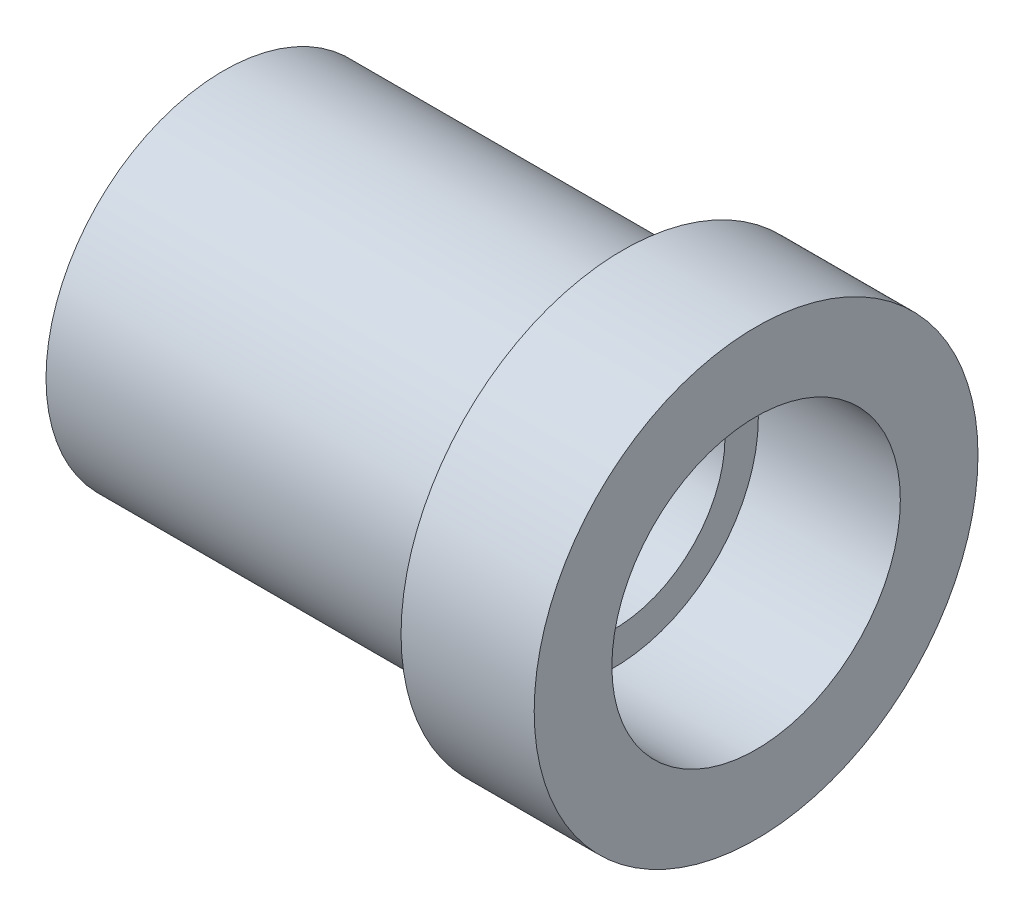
ISO-10303-21;
HEADER;
FILE_DESCRIPTION(('STEP AP214'),'2;1');
FILE_NAME('part.step','',(''),(''),'','','');
FILE_SCHEMA(('AUTOMOTIVE_DESIGN { 1 0 10303 214 1 1 1 1 }'));
ENDSEC;
DATA;
#1=APPLICATION_CONTEXT('core data for automotive mechanical design processes');
#2=APPLICATION_PROTOCOL_DEFINITION('international standard','automotive_design',2000,#1);
#3=PRODUCT_CONTEXT('',#1,'mechanical');
#4=PRODUCT('Part','Part','',(#3));
#5=PRODUCT_RELATED_PRODUCT_CATEGORY('part','',(#4));
#6=PRODUCT_DEFINITION_FORMATION('','',#4);
#7=PRODUCT_DEFINITION_CONTEXT('part definition',#1,'design');
#8=PRODUCT_DEFINITION('design','',#6,#7);
#9=PRODUCT_DEFINITION_SHAPE('','',#8);
#10=(LENGTH_UNIT() NAMED_UNIT(*) SI_UNIT(.MILLI.,.METRE.));
#11=(NAMED_UNIT(*) PLANE_ANGLE_UNIT() SI_UNIT($,.RADIAN.));
#12=(NAMED_UNIT(*) SI_UNIT($,.STERADIAN.) SOLID_ANGLE_UNIT());
#13=UNCERTAINTY_MEASURE_WITH_UNIT(LENGTH_MEASURE(1.E-05),#10,'distance_accuracy_value','');
#14=(GEOMETRIC_REPRESENTATION_CONTEXT(3) GLOBAL_UNCERTAINTY_ASSIGNED_CONTEXT((#13)) GLOBAL_UNIT_ASSIGNED_CONTEXT((#10,
#11,#12)) REPRESENTATION_CONTEXT('',''));
#15=CARTESIAN_POINT('',(0.,0.,0.));
#16=DIRECTION('',(0.,0.,1.));
#17=DIRECTION('',(1.,0.,0.));
#18=AXIS2_PLACEMENT_3D('',#15,#16,#17);
#19=CARTESIAN_POINT('',(30.6282488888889,0.,0.));
#20=DIRECTION('',(1.,0.,0.));
#21=DIRECTION('',(0.,0.,-1.));
#22=AXIS2_PLACEMENT_3D('',#19,#20,#21);
#23=CYLINDRICAL_SURFACE('',#22,2.49999999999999);
#24=CARTESIAN_POINT('',(18.6282488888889,0.,0.));
#25=DIRECTION('',(1.,0.,0.));
#26=DIRECTION('',(0.,0.,-1.));
#27=AXIS2_PLACEMENT_3D('',#24,#25,#26);
#28=CIRCLE('',#27,2.5);
#29=CARTESIAN_POINT('',(18.6282488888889,0.,-2.5));
#30=VERTEX_POINT('',#29);
#31=EDGE_CURVE('E44',#30,#30,#28,.T.);
#32=ORIENTED_EDGE('',*,*,#31,.F.);
#33=EDGE_LOOP('',(#32));
#34=FACE_BOUND('',#33,.T.);
#35=CARTESIAN_POINT('',(27.4282488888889,0.,0.));
#36=DIRECTION('',(1.,0.,0.));
#37=DIRECTION('',(0.,0.,-1.));
#38=AXIS2_PLACEMENT_3D('',#35,#36,#37);
#39=CIRCLE('',#38,2.49999999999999);
#40=CARTESIAN_POINT('',(27.4282488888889,0.,-2.49999999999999));
#41=VERTEX_POINT('',#40);
#42=EDGE_CURVE('E28',#41,#41,#39,.F.);
#43=ORIENTED_EDGE('',*,*,#42,.F.);
#44=EDGE_LOOP('',(#43));
#45=FACE_BOUND('',#44,.T.);
#46=ADVANCED_FACE('F24',(#34,#45),#23,.F.);
#47=CARTESIAN_POINT('',(18.6282488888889,0.,0.));
#48=DIRECTION('',(1.,0.,0.));
#49=DIRECTION('',(0.,0.,-1.));
#50=AXIS2_PLACEMENT_3D('',#47,#48,#49);
#51=PLANE('',#50);
#52=ORIENTED_EDGE('',*,*,#31,.T.);
#53=EDGE_LOOP('',(#52));
#54=FACE_BOUND('',#53,.T.);
#55=CARTESIAN_POINT('',(18.6282488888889,0.,0.));
#56=DIRECTION('',(-1.,0.,0.));
#57=DIRECTION('',(0.,0.,1.));
#58=AXIS2_PLACEMENT_3D('',#55,#56,#57);
#59=CIRCLE('',#58,4.);
#60=CARTESIAN_POINT('',(18.6282488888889,0.,4.));
#61=VERTEX_POINT('',#60);
#62=EDGE_CURVE('E10',#61,#61,#59,.T.);
#63=ORIENTED_EDGE('',*,*,#62,.T.);
#64=EDGE_LOOP('',(#63));
#65=FACE_BOUND('',#64,.T.);
#66=ADVANCED_FACE('F26',(#54,#65),#51,.F.);
#67=CARTESIAN_POINT('',(-32.7627022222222,0.,0.));
#68=DIRECTION('',(-1.,0.,0.));
#69=DIRECTION('',(0.,0.,1.));
#70=AXIS2_PLACEMENT_3D('',#67,#68,#69);
#71=CYLINDRICAL_SURFACE('',#70,4.);
#72=ORIENTED_EDGE('',*,*,#62,.F.);
#73=EDGE_LOOP('',(#72));
#74=FACE_BOUND('',#73,.T.);
#75=CARTESIAN_POINT('',(27.6282488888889,0.,0.));
#76=DIRECTION('',(-1.,0.,0.));
#77=DIRECTION('',(0.,0.,1.));
#78=AXIS2_PLACEMENT_3D('',#75,#76,#77);
#79=CIRCLE('',#78,4.);
#80=CARTESIAN_POINT('',(27.6282488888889,0.,4.));
#81=VERTEX_POINT('',#80);
#82=EDGE_CURVE('E32',#81,#81,#79,.T.);
#83=ORIENTED_EDGE('',*,*,#82,.T.);
#84=EDGE_LOOP('',(#83));
#85=FACE_BOUND('',#84,.T.);
#86=ADVANCED_FACE('F72',(#74,#85),#71,.T.);
#87=CARTESIAN_POINT('',(27.6282488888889,4.,0.));
#88=DIRECTION('',(1.,0.,0.));
#89=DIRECTION('',(0.,0.,-1.));
#90=AXIS2_PLACEMENT_3D('',#87,#88,#89);
#91=PLANE('',#90);
#92=ORIENTED_EDGE('',*,*,#82,.F.);
#93=EDGE_LOOP('',(#92));
#94=FACE_BOUND('',#93,.T.);
#95=CARTESIAN_POINT('',(27.6282488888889,0.,0.));
#96=DIRECTION('',(-1.,0.,0.));
#97=DIRECTION('',(0.,0.,1.));
#98=AXIS2_PLACEMENT_3D('',#95,#96,#97);
#99=CIRCLE('',#98,5.);
#100=CARTESIAN_POINT('',(27.6282488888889,0.,5.));
#101=VERTEX_POINT('',#100);
#102=EDGE_CURVE('E36',#101,#101,#99,.T.);
#103=ORIENTED_EDGE('',*,*,#102,.T.);
#104=EDGE_LOOP('',(#103));
#105=FACE_BOUND('',#104,.T.);
#106=ADVANCED_FACE('F65',(#94,#105),#91,.F.);
#107=CARTESIAN_POINT('',(-32.7627022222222,0.,0.));
#108=DIRECTION('',(-1.,0.,0.));
#109=DIRECTION('',(0.,0.,1.));
#110=AXIS2_PLACEMENT_3D('',#107,#108,#109);
#111=CYLINDRICAL_SURFACE('',#110,5.);
#112=ORIENTED_EDGE('',*,*,#102,.F.);
#113=EDGE_LOOP('',(#112));
#114=FACE_BOUND('',#113,.T.);
#115=CARTESIAN_POINT('',(30.6282488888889,0.,0.));
#116=DIRECTION('',(-1.,0.,0.));
#117=DIRECTION('',(0.,0.,1.));
#118=AXIS2_PLACEMENT_3D('',#115,#116,#117);
#119=CIRCLE('',#118,5.);
#120=CARTESIAN_POINT('',(30.6282488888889,0.,5.));
#121=VERTEX_POINT('',#120);
#122=EDGE_CURVE('E41',#121,#121,#119,.T.);
#123=ORIENTED_EDGE('',*,*,#122,.T.);
#124=EDGE_LOOP('',(#123));
#125=FACE_BOUND('',#124,.T.);
#126=ADVANCED_FACE('F60',(#114,#125),#111,.T.);
#127=CARTESIAN_POINT('',(30.6282488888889,0.,0.));
#128=DIRECTION('',(-1.,0.,0.));
#129=DIRECTION('',(0.,0.,1.));
#130=AXIS2_PLACEMENT_3D('',#127,#128,#129);
#131=PLANE('',#130);
#132=CARTESIAN_POINT('',(30.6282488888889,0.,0.));
#133=DIRECTION('',(1.,0.,0.));
#134=DIRECTION('',(0.,0.,-1.));
#135=AXIS2_PLACEMENT_3D('',#132,#133,#134);
#136=CIRCLE('',#135,3.25);
#137=CARTESIAN_POINT('',(30.6282488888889,0.,-3.25));
#138=VERTEX_POINT('',#137);
#139=EDGE_CURVE('E50',#138,#138,#136,.T.);
#140=ORIENTED_EDGE('',*,*,#139,.F.);
#141=EDGE_LOOP('',(#140));
#142=FACE_BOUND('',#141,.T.);
#143=ORIENTED_EDGE('',*,*,#122,.F.);
#144=EDGE_LOOP('',(#143));
#145=FACE_BOUND('',#144,.T.);
#146=ADVANCED_FACE('F56',(#142,#145),#131,.F.);
#147=CARTESIAN_POINT('',(27.4282488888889,0.,0.));
#148=DIRECTION('',(1.,0.,0.));
#149=DIRECTION('',(0.,0.,-1.));
#150=AXIS2_PLACEMENT_3D('',#147,#148,#149);
#151=PLANE('',#150);
#152=CARTESIAN_POINT('',(27.4282488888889,0.,0.));
#153=DIRECTION('',(1.,0.,0.));
#154=DIRECTION('',(0.,0.,-1.));
#155=AXIS2_PLACEMENT_3D('',#152,#153,#154);
#156=CIRCLE('',#155,3.25);
#157=CARTESIAN_POINT('',(27.4282488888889,0.,-3.25));
#158=VERTEX_POINT('',#157);
#159=EDGE_CURVE('E47',#158,#158,#156,.T.);
#160=ORIENTED_EDGE('',*,*,#159,.T.);
#161=EDGE_LOOP('',(#160));
#162=FACE_BOUND('',#161,.T.);
#163=ORIENTED_EDGE('',*,*,#42,.T.);
#164=EDGE_LOOP('',(#163));
#165=FACE_BOUND('',#164,.T.);
#166=ADVANCED_FACE('F59',(#162,#165),#151,.T.);
#167=CARTESIAN_POINT('',(27.4282488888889,0.,0.));
#168=DIRECTION('',(1.,0.,0.));
#169=DIRECTION('',(0.,0.,-1.));
#170=AXIS2_PLACEMENT_3D('',#167,#168,#169);
#171=CYLINDRICAL_SURFACE('',#170,3.25);
#172=ORIENTED_EDGE('',*,*,#159,.F.);
#173=EDGE_LOOP('',(#172));
#174=FACE_BOUND('',#173,.T.);
#175=ORIENTED_EDGE('',*,*,#139,.T.);
#176=EDGE_LOOP('',(#175));
#177=FACE_BOUND('',#176,.T.);
#178=ADVANCED_FACE('F54',(#174,#177),#171,.F.);
#179=CLOSED_SHELL('',(#46,#66,#86,#106,#126,#146,#166,#178));
#180=MANIFOLD_SOLID_BREP('B2',#179);
#181=ADVANCED_BREP_SHAPE_REPRESENTATION('',(#18,#180),#14);
#182=SHAPE_DEFINITION_REPRESENTATION(#9,#181);
ENDSEC;
END-ISO-10303-21;
